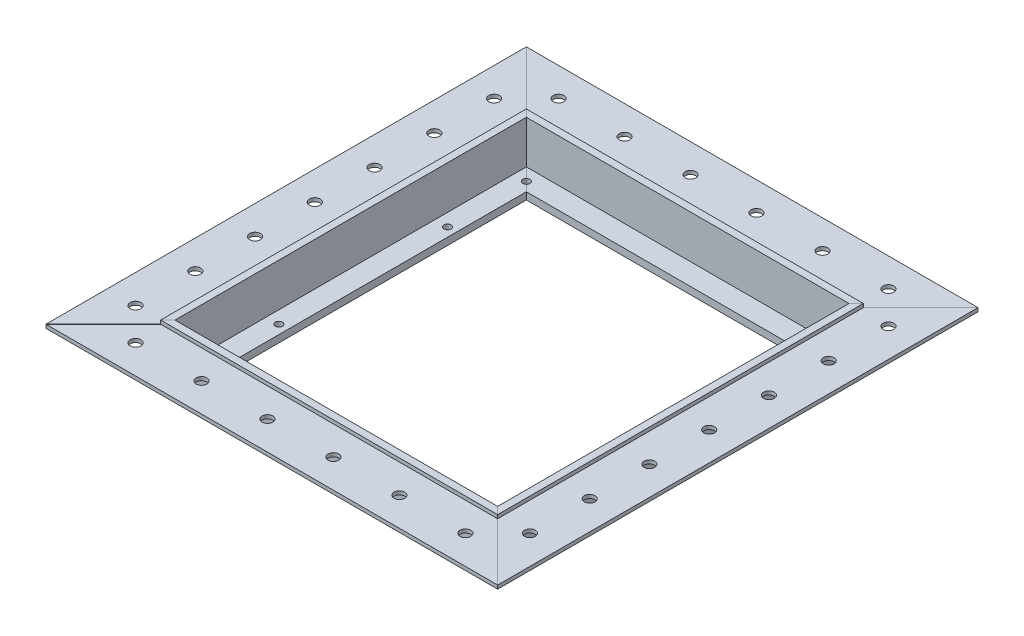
from build123d import *

# Parameters (mm, degrees)
BOSS_EXTRUDE1_DEPTH   = 77.7875
BOSS_EXTRUDE1_2_DEPTH = 77.7875
BOSS_EXTRUDE2_DEPTH   = 100.0125
SKETCH4_W             = 25.4
SKETCH4_H             = 212.725
CUT_EXTRUDE1_DEPTH    = 158.75
SKETCH5_W             = 25.4
SKETCH5_H             = 19.05
CUT_EXTRUDE2_DEPTH    = 249.604730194
CUT_EXTRUDE3_DEPTH    = 196.004199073
SKETCH7_R             = 2.38125
CUT_EXTRUDE4_DEPTH    = 2.54
LPATTERN1_COUNT       = 7
LPATTERN1_PITCH       = 26.458333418
SKETCH8_R             = 2.3749
CUT_EXTRUDE5_DEPTH    = 2.54
LPATTERN2_COUNT       = 6
LPATTERN2_PITCH       = 29.21
SKETCH9_R             = 2.3749
SKETCH9_R_2           = 2.38125
CUT_EXTRUDE6_DEPTH    = 2.54
SKETCH16_R            = 1.5875
CUT_EXTRUDE7_DEPTH    = 195.667895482


with BuildPart() as part:
    # Sketch1 → Boss-Extrude1 (new, symmetric)
    with BuildSketch(Plane.XY):
        Polygon((123.825, 3.175), (123.825, 0), (136.525, 0), (136.525, 19.05), (161.925, 19.05), (161.925, 20.6375), (136.525, 20.6375), (136.525, 22.225), (133.35, 22.225), (133.35, 3.175), align=None)
    extrude(amount=BOSS_EXTRUDE1_DEPTH, both=True)



with BuildPart() as body_2:
    # Sketch1 → Boss-Extrude1 2 (new, symmetric)
    with BuildSketch(Plane.XY):
        Polygon((0, 0), (-12.7, 0), (-12.7, 19.05), (-38.1, 19.05), (-38.1, 20.6375), (-12.7, 20.6375), (-12.7, 22.225), (-9.525, 22.225), (-9.525, 3.175), (0, 3.175), align=None)
    extrude(amount=BOSS_EXTRUDE1_2_DEPTH, both=True)


with BuildPart() as part_1:
    add(part.part)

    add(body_2.part)  # Boss-Extrude2 merges body 2
    # Sketch3 → Boss-Extrude2 (add, symmetric)
    with BuildSketch(Plane.ZY.offset(-61.9125)):
        Polygon((-68.2625, 3.175), (-68.2625, 0), (-80.9625, 0), (-80.9625, 19.05), (-106.3625, 19.05), (-106.3625, 20.6375), (-80.9625, 20.6375), (-80.9625, 22.225), (-77.7875, 22.225), (-77.7875, 3.175), align=None)
        Polygon((68.2625, 3.175), (68.2625, 0), (80.9625, 0), (80.9625, 19.05), (106.3625, 19.05), (106.3625, 20.6375), (80.9625, 20.6375), (80.9625, 22.225), (77.7875, 22.225), (77.7875, 3.175), align=None)
    extrude(amount=BOSS_EXTRUDE2_DEPTH, both=True)

    # Sketch4 → Cut-Extrude1 (cut)
    with BuildSketch(Plane(origin=(0, 20.6375, 0), x_dir=(1, 0, 0), z_dir=(0, 1, 0))):
        with Locations((149.225, 0)):
            Rectangle(SKETCH4_W, SKETCH4_H)
        with Locations((-25.4, 0)):
            Rectangle(SKETCH4_W, SKETCH4_H)
    extrude(amount=CUT_EXTRUDE1_DEPTH, mode=Mode.SUBTRACT)

    # Sketch5 → Cut-Extrude2 (cut, through all)
    with BuildSketch(Plane.XY.offset(80.9625)):
        with Locations((-25.4, 9.525)):
            Rectangle(SKETCH5_W, SKETCH5_H)
        with Locations((149.225, 9.525)):
            Rectangle(SKETCH5_W, SKETCH5_H)
    extrude(amount=-CUT_EXTRUDE2_DEPTH, mode=Mode.SUBTRACT)

    # Sketch6 → Cut-Extrude3 (cut, through all)
    with BuildSketch(Plane(origin=(0, 22.225, 0), x_dir=(1, 0, 0), z_dir=(0, 1, 0))):
        Polygon((161.907039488, 106.380460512), (114.638990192, 59.112411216), (115.032679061, 59.434258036), (161.942960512, 106.344539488), align=None)
        Polygon((-38.082039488, 106.380460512), (-38.117960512, 106.344539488), (8.792320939, 59.434258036), (9.186009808, 59.112411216), align=None)
        Polygon((-38.082039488, -106.380460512), (9.186009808, -59.112411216), (8.792320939, -59.434258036), (-38.117960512, -106.344539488), align=None)
        Polygon((161.907039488, -106.380460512), (161.942960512, -106.344539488), (115.032679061, -59.434258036), (114.638990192, -59.112411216), align=None)
    extrude(amount=-CUT_EXTRUDE3_DEPTH, mode=Mode.SUBTRACT)


with BuildPart() as cut_extrude3_piece_1:
    # of the separate pieces the step leaves, piece 1, a body of its own (cut_extrude3_pieces)
    add(part_1.part.solids().sort_by_distance((-9.525, 3.175, -77.751578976))[0])

    # Sketch7 → Cut-Extrude4 (cut)
    with BuildSketch(Plane(origin=(0, 20.6375, 0), x_dir=(1, 0, 0), z_dir=(0, 1, 0))):
        with Locations(Location((-25.4, 79.375, 0), (0, 0, 180))):
            Circle(SKETCH7_R)
    cut_extrude4 = extrude(amount=-CUT_EXTRUDE4_DEPTH, mode=Mode.SUBTRACT)

    # LPattern1: Cut-Extrude4 ×7
    with Locations(*[(0, 0, i * LPATTERN1_PITCH) for i in range(1, LPATTERN1_COUNT)]):
        add(cut_extrude4, mode=Mode.SUBTRACT)


with BuildPart() as cut_extrude3_piece_2:
    # of the separate pieces the step leaves, piece 2, a body of its own (cut_extrude3_pieces)
    add(part_1.part.solids().sort_by_distance((133.35, 3.175, 77.751578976))[0])


with BuildPart() as cut_extrude3_piece_3:
    # of the separate pieces the step leaves, piece 3, a body of its own (cut_extrude3_pieces)
    add(part_1.part.solids().sort_by_distance((133.314078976, 3.175, -77.7875))[0])

    # Sketch8 → Cut-Extrude5 (cut)
    with BuildSketch(Plane(origin=(0, 20.6375, 0), x_dir=(1, 0, 0), z_dir=(0, 1, 0))):
        with Locations(Location((-11.1125, 93.6625, 0), (0, 0, 180))):
            Circle(SKETCH8_R)
    cut_extrude5 = extrude(amount=-CUT_EXTRUDE5_DEPTH, mode=Mode.SUBTRACT)

    # LPattern2: Cut-Extrude5 ×6
    with Locations(*[(i * LPATTERN2_PITCH, 0, 0) for i in range(1, LPATTERN2_COUNT)]):
        add(cut_extrude5, mode=Mode.SUBTRACT)


with BuildPart() as cut_extrude3_piece_4:
    # of the separate pieces the step leaves, piece 4, a body of its own (cut_extrude3_pieces)
    add(part_1.part.solids().sort_by_distance((-9.489078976, 3.175, 77.7875))[0])


with BuildPart() as cut_extrude6_tool:
    # Sketch9 → Cut-Extrude6 (new body)
    with BuildSketch(Plane(origin=(0, 20.6375, 0), x_dir=(1, 0, 0), z_dir=(0, 1, 0))):
        with Locations(Location((-11.1125, -93.6625, 0), (0, 0, 270))):
            Circle(SKETCH9_R)
        with Locations(Location((18.0975, -93.6625, 0), (0, 0, 270))):
            Circle(SKETCH9_R)
        with Locations(Location((47.3075, -93.6625, 0), (0, 0, 270))):
            Circle(SKETCH9_R)
        with Locations(Location((76.5175, -93.6625, 0), (0, 0, 270))):
            Circle(SKETCH9_R)
        with Locations(Location((105.7275, -93.6625, 0), (0, 0, 270))):
            Circle(SKETCH9_R)
        with Locations(Location((134.9375, -93.6625, 0), (0, 0, 270))):
            Circle(SKETCH9_R)
        with Locations(Location((149.225, 79.375, 0), (0, 0, 270))):
            Circle(SKETCH9_R_2)
        with Locations(Location((149.225, 52.916666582, 0), (0, 0, 270))):
            Circle(SKETCH9_R_2)
        with Locations(Location((149.225, 26.458333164, 0), (0, 0, 270))):
            Circle(SKETCH9_R_2)
        with Locations(Location((149.225, -2.54e-07, 0), (0, 0, 270))):
            Circle(SKETCH9_R_2)
        with Locations(Location((149.225, -26.458333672, 0), (0, 0, 270))):
            Circle(SKETCH9_R_2)
        with Locations(Location((149.225, -52.91666709, 0), (0, 0, 270))):
            Circle(SKETCH9_R_2)
        with Locations(Location((149.225, -79.375000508, 0), (0, 0, 270))):
            Circle(SKETCH9_R_2)
    extrude(amount=-CUT_EXTRUDE6_DEPTH)


with BuildPart() as cut_extrude3_piece_2_1:
    add(cut_extrude3_piece_2.part)

    # Cut-Extrude6: cut by cut_extrude6_tool
    add(cut_extrude6_tool.part, mode=Mode.SUBTRACT)


with BuildPart() as cut_extrude3_piece_4_1:
    add(cut_extrude3_piece_4.part)

    # Cut-Extrude6: cut by cut_extrude6_tool
    add(cut_extrude6_tool.part, mode=Mode.SUBTRACT)


with BuildPart() as cut_extrude7_tool:
    # Sketch16 → Cut-Extrude7 (new, through all)
    with BuildSketch(Plane(origin=(0, 3.175, 0), x_dir=(1, 0, 0), z_dir=(0, 1, 0))):
        with Locations((-3.96875, 72.23125)):
            Circle(SKETCH16_R)
        with Locations((127.79375, 72.23125)):
            Circle(SKETCH16_R)
        with Locations((127.79375, -72.23125)):
            Circle(SKETCH16_R)
        with Locations((-3.96875, -72.23125)):
            Circle(SKETCH16_R)
        with Locations(Location((-3.96875, 37.30625, 0), (0, 0, 180))):
            Circle(SKETCH16_R)
        with Locations(Location((-3.96875, -37.30625, 0), (0, 0, 180))):
            Circle(SKETCH16_R)
        with Locations(Location((127.79375, -37.30625, 0), (0, 0, 180))):
            Circle(SKETCH16_R)
        with Locations(Location((127.79375, 37.30625, 0), (0, 0, 180))):
            Circle(SKETCH16_R)
    extrude(amount=-CUT_EXTRUDE7_DEPTH)


with BuildPart() as cut_extrude3_piece_1_1:
    add(cut_extrude3_piece_1.part)

    # Cut-Extrude7: cut by cut_extrude7_tool
    add(cut_extrude7_tool.part, mode=Mode.SUBTRACT)


with BuildPart() as cut_extrude3_piece_2_2:
    add(cut_extrude3_piece_2_1.part)

    # Cut-Extrude7: cut by cut_extrude7_tool
    add(cut_extrude7_tool.part, mode=Mode.SUBTRACT)


with BuildPart() as cut_extrude3_piece_3_1:
    add(cut_extrude3_piece_3.part)

    # Cut-Extrude7: cut by cut_extrude7_tool
    add(cut_extrude7_tool.part, mode=Mode.SUBTRACT)


with BuildPart() as cut_extrude3_piece_4_2:
    add(cut_extrude3_piece_4_1.part)

    # Cut-Extrude7: cut by cut_extrude7_tool
    add(cut_extrude7_tool.part, mode=Mode.SUBTRACT)


solid = Compound([cut_extrude3_piece_1_1.part, cut_extrude3_piece_2_2.part, cut_extrude3_piece_3_1.part, cut_extrude3_piece_4_2.part])
